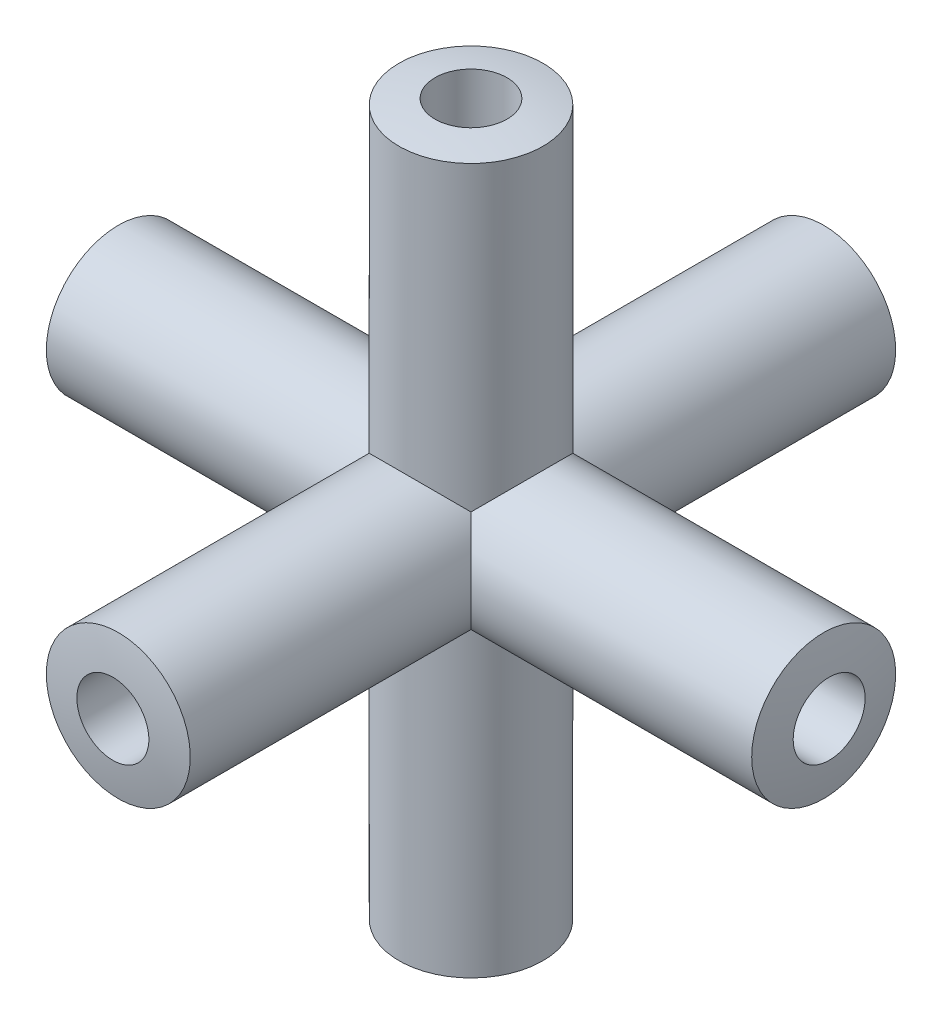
ISO-10303-21;
HEADER;
FILE_DESCRIPTION(('STEP AP214'),'2;1');
FILE_NAME('part.step','',(''),(''),'','','');
FILE_SCHEMA(('AUTOMOTIVE_DESIGN { 1 0 10303 214 1 1 1 1 }'));
ENDSEC;
DATA;
#1=APPLICATION_CONTEXT('core data for automotive mechanical design processes');
#2=APPLICATION_PROTOCOL_DEFINITION('international standard','automotive_design',2000,#1);
#3=PRODUCT_CONTEXT('',#1,'mechanical');
#4=PRODUCT('Part','Part','',(#3));
#5=PRODUCT_RELATED_PRODUCT_CATEGORY('part','',(#4));
#6=PRODUCT_DEFINITION_FORMATION('','',#4);
#7=PRODUCT_DEFINITION_CONTEXT('part definition',#1,'design');
#8=PRODUCT_DEFINITION('design','',#6,#7);
#9=PRODUCT_DEFINITION_SHAPE('','',#8);
#10=(LENGTH_UNIT() NAMED_UNIT(*) SI_UNIT(.MILLI.,.METRE.));
#11=(NAMED_UNIT(*) PLANE_ANGLE_UNIT() SI_UNIT($,.RADIAN.));
#12=(NAMED_UNIT(*) SI_UNIT($,.STERADIAN.) SOLID_ANGLE_UNIT());
#13=UNCERTAINTY_MEASURE_WITH_UNIT(LENGTH_MEASURE(1.E-05),#10,'distance_accuracy_value','');
#14=(GEOMETRIC_REPRESENTATION_CONTEXT(3) GLOBAL_UNCERTAINTY_ASSIGNED_CONTEXT((#13)) GLOBAL_UNIT_ASSIGNED_CONTEXT((#10,
#11,#12)) REPRESENTATION_CONTEXT('',''));
#15=CARTESIAN_POINT('',(0.,0.,0.));
#16=DIRECTION('',(0.,0.,1.));
#17=DIRECTION('',(1.,0.,0.));
#18=AXIS2_PLACEMENT_3D('',#15,#16,#17);
#19=CARTESIAN_POINT('',(-1.59032785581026E-05,-1.47377050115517E-05,37.4999840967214));
#20=DIRECTION('',(0.,0.,-1.));
#21=DIRECTION('',(-1.,0.,0.));
#22=AXIS2_PLACEMENT_3D('',#19,#20,#21);
#23=CYLINDRICAL_SURFACE('',#22,3.75);
#24=CARTESIAN_POINT('',(-1.59032784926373E-05,-1.47377049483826E-05,-18.7500159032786));
#25=DIRECTION('',(0.,0.,-1.));
#26=DIRECTION('',(0.,1.,0.));
#27=AXIS2_PLACEMENT_3D('',#24,#25,#26);
#28=CIRCLE('',#27,3.75);
#29=CARTESIAN_POINT('',(-1.59032784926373E-05,3.74998526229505,-18.7500159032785));
#30=VERTEX_POINT('',#29);
#31=EDGE_CURVE('E263',#30,#30,#28,.T.);
#32=ORIENTED_EDGE('',*,*,#31,.F.);
#33=EDGE_LOOP('',(#32));
#34=FACE_BOUND('',#33,.T.);
#35=CARTESIAN_POINT('',(-1.59032785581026E-05,-1.47377050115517E-05,-37.3120447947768));
#36=DIRECTION('',(0.,0.,1.));
#37=DIRECTION('',(1.,0.,0.));
#38=AXIS2_PLACEMENT_3D('',#35,#36,#37);
#39=CIRCLE('',#38,3.75);
#40=CARTESIAN_POINT('',(3.74998409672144,-1.47377050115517E-05,-37.3120447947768));
#41=VERTEX_POINT('',#40);
#42=EDGE_CURVE('E188',#41,#41,#39,.F.);
#43=ORIENTED_EDGE('',*,*,#42,.T.);
#44=EDGE_LOOP('',(#43));
#45=FACE_BOUND('',#44,.T.);
#46=ADVANCED_FACE('F38',(#34,#45),#23,.F.);
#47=CARTESIAN_POINT('',(-1.59032786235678E-05,-1.47377050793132E-05,18.7499840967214));
#48=DIRECTION('',(0.,0.,1.));
#49=DIRECTION('',(0.,1.,0.));
#50=AXIS2_PLACEMENT_3D('',#47,#48,#49);
#51=CIRCLE('',#50,3.75);
#52=CARTESIAN_POINT('',(-1.59032786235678E-05,3.74998526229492,18.7499840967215));
#53=VERTEX_POINT('',#52);
#54=EDGE_CURVE('E251',#53,#53,#51,.T.);
#55=ORIENTED_EDGE('',*,*,#54,.F.);
#56=EDGE_LOOP('',(#55));
#57=FACE_BOUND('',#56,.T.);
#58=CARTESIAN_POINT('',(-1.59032785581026E-05,-1.47377050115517E-05,37.3120129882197));
#59=DIRECTION('',(0.,0.,-1.));
#60=DIRECTION('',(-1.,0.,0.));
#61=AXIS2_PLACEMENT_3D('',#58,#59,#60);
#62=CIRCLE('',#61,3.75);
#63=CARTESIAN_POINT('',(-3.75001590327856,-1.47377050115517E-05,37.3120129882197));
#64=VERTEX_POINT('',#63);
#65=EDGE_CURVE('E176',#64,#64,#62,.F.);
#66=ORIENTED_EDGE('',*,*,#65,.T.);
#67=EDGE_LOOP('',(#66));
#68=FACE_BOUND('',#67,.T.);
#69=ADVANCED_FACE('F300',(#57,#68),#23,.F.);
#70=CARTESIAN_POINT('',(37.4999840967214,-1.47377050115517E-05,-1.59032785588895E-05));
#71=DIRECTION('',(-1.,0.,0.));
#72=DIRECTION('',(0.,0.,1.));
#73=AXIS2_PLACEMENT_3D('',#70,#71,#72);
#74=CYLINDRICAL_SURFACE('',#73,3.75);
#75=CARTESIAN_POINT('',(-18.7500159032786,-1.47377049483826E-05,-1.59032785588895E-05));
#76=DIRECTION('',(-1.,0.,0.));
#77=DIRECTION('',(0.,1.,0.));
#78=AXIS2_PLACEMENT_3D('',#75,#76,#77);
#79=CIRCLE('',#78,3.75);
#80=CARTESIAN_POINT('',(-18.7500159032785,3.74998526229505,-1.59032785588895E-05));
#81=VERTEX_POINT('',#80);
#82=EDGE_CURVE('E239',#81,#81,#79,.T.);
#83=ORIENTED_EDGE('',*,*,#82,.F.);
#84=EDGE_LOOP('',(#83));
#85=FACE_BOUND('',#84,.T.);
#86=CARTESIAN_POINT('',(-37.3120447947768,-1.47377050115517E-05,-1.59032785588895E-05));
#87=DIRECTION('',(1.,0.,0.));
#88=DIRECTION('',(0.,0.,-1.));
#89=AXIS2_PLACEMENT_3D('',#86,#87,#88);
#90=CIRCLE('',#89,3.75);
#91=CARTESIAN_POINT('',(-37.3120447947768,-1.47377050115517E-05,-3.75001590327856));
#92=VERTEX_POINT('',#91);
#93=EDGE_CURVE('E194',#92,#92,#90,.F.);
#94=ORIENTED_EDGE('',*,*,#93,.T.);
#95=EDGE_LOOP('',(#94));
#96=FACE_BOUND('',#95,.T.);
#97=ADVANCED_FACE('F372',(#85,#96),#74,.F.);
#98=CARTESIAN_POINT('',(18.7499840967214,-1.47377050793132E-05,-1.59032785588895E-05));
#99=DIRECTION('',(1.,0.,0.));
#100=DIRECTION('',(0.,1.,0.));
#101=AXIS2_PLACEMENT_3D('',#98,#99,#100);
#102=CIRCLE('',#101,3.75);
#103=CARTESIAN_POINT('',(18.7499840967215,3.74998526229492,-1.59032785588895E-05));
#104=VERTEX_POINT('',#103);
#105=EDGE_CURVE('E227',#104,#104,#102,.T.);
#106=ORIENTED_EDGE('',*,*,#105,.F.);
#107=EDGE_LOOP('',(#106));
#108=FACE_BOUND('',#107,.T.);
#109=CARTESIAN_POINT('',(37.3120129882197,-1.47377050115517E-05,-1.59032785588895E-05));
#110=DIRECTION('',(-1.,0.,0.));
#111=DIRECTION('',(0.,0.,1.));
#112=AXIS2_PLACEMENT_3D('',#109,#110,#111);
#113=CIRCLE('',#112,3.75);
#114=CARTESIAN_POINT('',(37.3120129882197,-1.47377050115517E-05,3.74998409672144));
#115=VERTEX_POINT('',#114);
#116=EDGE_CURVE('E197',#115,#115,#113,.F.);
#117=ORIENTED_EDGE('',*,*,#116,.T.);
#118=EDGE_LOOP('',(#117));
#119=FACE_BOUND('',#118,.T.);
#120=ADVANCED_FACE('F369',(#108,#119),#74,.F.);
#121=CARTESIAN_POINT('',(-1.59032785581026E-05,37.499985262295,-1.59032785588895E-05));
#122=DIRECTION('',(0.,-1.,0.));
#123=DIRECTION('',(0.,0.,-1.));
#124=AXIS2_PLACEMENT_3D('',#121,#122,#123);
#125=CYLINDRICAL_SURFACE('',#124,3.75);
#126=CARTESIAN_POINT('',(-1.59032785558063E-05,-18.750014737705,-1.59032785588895E-05));
#127=DIRECTION('',(0.,-1.,0.));
#128=DIRECTION('',(-1.,0.,0.));
#129=AXIS2_PLACEMENT_3D('',#126,#127,#128);
#130=CIRCLE('',#129,3.75);
#131=CARTESIAN_POINT('',(-3.75001590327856,-18.750014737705,-1.59032785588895E-05));
#132=VERTEX_POINT('',#131);
#133=EDGE_CURVE('E215',#132,#132,#130,.T.);
#134=ORIENTED_EDGE('',*,*,#133,.F.);
#135=EDGE_LOOP('',(#134));
#136=FACE_BOUND('',#135,.T.);
#137=CARTESIAN_POINT('',(-1.59032785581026E-05,-37.3120436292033,-1.59032785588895E-05));
#138=DIRECTION('',(0.,1.,0.));
#139=DIRECTION('',(0.,0.,1.));
#140=AXIS2_PLACEMENT_3D('',#137,#138,#139);
#141=CIRCLE('',#140,3.75);
#142=CARTESIAN_POINT('',(-3.75001590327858,-37.3120436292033,-1.59032785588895E-05));
#143=VERTEX_POINT('',#142);
#144=EDGE_CURVE('E42',#143,#143,#141,.F.);
#145=ORIENTED_EDGE('',*,*,#144,.T.);
#146=EDGE_LOOP('',(#145));
#147=FACE_BOUND('',#146,.T.);
#148=ADVANCED_FACE('F371',(#136,#147),#125,.F.);
#149=CARTESIAN_POINT('',(-1.59032785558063E-05,18.749985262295,-1.59032785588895E-05));
#150=DIRECTION('',(0.,1.,0.));
#151=DIRECTION('',(-1.,0.,0.));
#152=AXIS2_PLACEMENT_3D('',#149,#150,#151);
#153=CIRCLE('',#152,3.75);
#154=CARTESIAN_POINT('',(-3.75001590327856,18.749985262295,-1.59032785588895E-05));
#155=VERTEX_POINT('',#154);
#156=EDGE_CURVE('E203',#155,#155,#153,.T.);
#157=ORIENTED_EDGE('',*,*,#156,.F.);
#158=EDGE_LOOP('',(#157));
#159=FACE_BOUND('',#158,.T.);
#160=CARTESIAN_POINT('',(-1.59032785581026E-05,37.3120141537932,-1.59032785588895E-05));
#161=DIRECTION('',(0.,-1.,0.));
#162=DIRECTION('',(0.,0.,-1.));
#163=AXIS2_PLACEMENT_3D('',#160,#161,#162);
#164=CIRCLE('',#163,3.75);
#165=CARTESIAN_POINT('',(-3.75001590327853,37.3120141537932,-1.59032785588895E-05));
#166=VERTEX_POINT('',#165);
#167=EDGE_CURVE('E170',#166,#166,#164,.F.);
#168=ORIENTED_EDGE('',*,*,#167,.T.);
#169=EDGE_LOOP('',(#168));
#170=FACE_BOUND('',#169,.T.);
#171=ADVANCED_FACE('F378',(#159,#170),#125,.F.);
#172=CARTESIAN_POINT('',(-1.59032785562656E-05,-15.000014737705,-1.59032785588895E-05));
#173=DIRECTION('',(0.,-1.,0.));
#174=DIRECTION('',(-1.,0.,0.));
#175=AXIS2_PLACEMENT_3D('',#172,#173,#174);
#176=CIRCLE('',#175,3.75);
#177=CARTESIAN_POINT('',(-3.75001590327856,-15.000014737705,-1.59032785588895E-05));
#178=VERTEX_POINT('',#177);
#179=EDGE_CURVE('E224',#178,#178,#176,.T.);
#180=ORIENTED_EDGE('',*,*,#179,.T.);
#181=EDGE_LOOP('',(#180));
#182=FACE_BOUND('',#181,.T.);
#183=CARTESIAN_POINT('',(-1.59032785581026E-05,-1.47377050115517E-05,-1.59032785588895E-05));
#184=DIRECTION('',(0.707106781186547,-0.707106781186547,0.));
#185=DIRECTION('',(-0.707106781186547,-0.707106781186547,0.));
#186=AXIS2_PLACEMENT_3D('',#183,#184,#185);
#187=ELLIPSE('',#186,5.30330085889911,3.75);
#188=CARTESIAN_POINT('',(-2.65166633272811,-2.65166516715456,2.65163452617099));
#189=VERTEX_POINT('',#188);
#190=CARTESIAN_POINT('',(-2.65166633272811,-2.65166516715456,-2.65166633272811));
#191=VERTEX_POINT('',#190);
#192=EDGE_CURVE('E11',#189,#191,#187,.T.);
#193=ORIENTED_EDGE('',*,*,#192,.F.);
#194=CARTESIAN_POINT('',(-1.59032785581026E-05,-1.47377050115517E-05,-1.59032785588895E-05));
#195=DIRECTION('',(0.,-0.707106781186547,-0.707106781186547));
#196=DIRECTION('',(0.,-0.707106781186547,0.707106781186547));
#197=AXIS2_PLACEMENT_3D('',#194,#195,#196);
#198=ELLIPSE('',#197,5.30330085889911,3.75);
#199=CARTESIAN_POINT('',(2.65163452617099,-2.65166516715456,2.65163452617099));
#200=VERTEX_POINT('',#199);
#201=EDGE_CURVE('E114',#200,#189,#198,.T.);
#202=ORIENTED_EDGE('',*,*,#201,.F.);
#203=CARTESIAN_POINT('',(-1.59032785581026E-05,-1.47377050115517E-05,-1.59032785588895E-05));
#204=DIRECTION('',(-0.707106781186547,-0.707106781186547,0.));
#205=DIRECTION('',(0.707106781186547,-0.707106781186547,0.));
#206=AXIS2_PLACEMENT_3D('',#203,#204,#205);
#207=ELLIPSE('',#206,5.30330085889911,3.75);
#208=CARTESIAN_POINT('',(2.65163452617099,-2.65166516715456,-2.65166633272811));
#209=VERTEX_POINT('',#208);
#210=EDGE_CURVE('E47',#209,#200,#207,.T.);
#211=ORIENTED_EDGE('',*,*,#210,.F.);
#212=CARTESIAN_POINT('',(-1.59032785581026E-05,-1.47377050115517E-05,-1.59032785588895E-05));
#213=DIRECTION('',(0.,-0.707106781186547,0.707106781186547));
#214=DIRECTION('',(0.,-0.707106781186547,-0.707106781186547));
#215=AXIS2_PLACEMENT_3D('',#212,#213,#214);
#216=ELLIPSE('',#215,5.30330085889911,3.75);
#217=EDGE_CURVE('E119',#191,#209,#216,.T.);
#218=ORIENTED_EDGE('',*,*,#217,.F.);
#219=EDGE_LOOP('',(#193,#202,#211,#218));
#220=FACE_BOUND('',#219,.T.);
#221=ADVANCED_FACE('F118',(#182,#220),#125,.F.);
#222=CARTESIAN_POINT('',(14.9999840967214,-1.47377050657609E-05,-1.59032785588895E-05));
#223=DIRECTION('',(1.,0.,0.));
#224=DIRECTION('',(0.,1.,0.));
#225=AXIS2_PLACEMENT_3D('',#222,#223,#224);
#226=CIRCLE('',#225,3.75);
#227=CARTESIAN_POINT('',(14.9999840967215,3.74998526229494,-1.59032785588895E-05));
#228=VERTEX_POINT('',#227);
#229=EDGE_CURVE('E236',#228,#228,#226,.T.);
#230=ORIENTED_EDGE('',*,*,#229,.T.);
#231=EDGE_LOOP('',(#230));
#232=FACE_BOUND('',#231,.T.);
#233=CARTESIAN_POINT('',(-1.59032785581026E-05,-1.47377050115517E-05,-1.59032785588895E-05));
#234=DIRECTION('',(0.707106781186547,-0.707106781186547,0.));
#235=DIRECTION('',(-0.707106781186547,-0.707106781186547,0.));
#236=AXIS2_PLACEMENT_3D('',#233,#234,#235);
#237=ELLIPSE('',#236,5.30330085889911,3.75);
#238=CARTESIAN_POINT('',(2.65163452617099,2.65163569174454,2.65163452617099));
#239=VERTEX_POINT('',#238);
#240=CARTESIAN_POINT('',(2.65163452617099,2.65163569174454,-2.65166633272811));
#241=VERTEX_POINT('',#240);
#242=EDGE_CURVE('E116',#239,#241,#237,.F.);
#243=ORIENTED_EDGE('',*,*,#242,.T.);
#244=CARTESIAN_POINT('',(-1.59032785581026E-05,-1.47377050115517E-05,-1.59032785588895E-05));
#245=DIRECTION('',(-0.707106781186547,0.,-0.707106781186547));
#246=DIRECTION('',(0.707106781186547,0.,-0.707106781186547));
#247=AXIS2_PLACEMENT_3D('',#244,#245,#246);
#248=ELLIPSE('',#247,5.30330085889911,3.75);
#249=EDGE_CURVE('E61',#241,#209,#248,.T.);
#250=ORIENTED_EDGE('',*,*,#249,.T.);
#251=ORIENTED_EDGE('',*,*,#210,.T.);
#252=CARTESIAN_POINT('',(-1.59032785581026E-05,-1.47377050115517E-05,-1.59032785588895E-05));
#253=DIRECTION('',(0.707106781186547,0.,-0.707106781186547));
#254=DIRECTION('',(-0.707106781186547,0.,-0.707106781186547));
#255=AXIS2_PLACEMENT_3D('',#252,#253,#254);
#256=ELLIPSE('',#255,5.30330085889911,3.75);
#257=EDGE_CURVE('E102',#200,#239,#256,.F.);
#258=ORIENTED_EDGE('',*,*,#257,.T.);
#259=EDGE_LOOP('',(#243,#250,#251,#258));
#260=FACE_BOUND('',#259,.T.);
#261=ADVANCED_FACE('F101',(#232,#260),#74,.F.);
#262=CARTESIAN_POINT('',(-15.0000159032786,-1.47377049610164E-05,-1.59032785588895E-05));
#263=DIRECTION('',(-1.,0.,0.));
#264=DIRECTION('',(0.,1.,0.));
#265=AXIS2_PLACEMENT_3D('',#262,#263,#264);
#266=CIRCLE('',#265,3.75);
#267=CARTESIAN_POINT('',(-15.0000159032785,3.74998526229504,-1.59032785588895E-05));
#268=VERTEX_POINT('',#267);
#269=EDGE_CURVE('E248',#268,#268,#266,.T.);
#270=ORIENTED_EDGE('',*,*,#269,.T.);
#271=EDGE_LOOP('',(#270));
#272=FACE_BOUND('',#271,.T.);
#273=CARTESIAN_POINT('',(-1.59032785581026E-05,-1.47377050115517E-05,-1.59032785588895E-05));
#274=DIRECTION('',(-0.707106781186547,-0.707106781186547,0.));
#275=DIRECTION('',(0.707106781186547,-0.707106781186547,0.));
#276=AXIS2_PLACEMENT_3D('',#273,#274,#275);
#277=ELLIPSE('',#276,5.30330085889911,3.75);
#278=CARTESIAN_POINT('',(-2.65166633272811,2.65163569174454,-2.65166633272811));
#279=VERTEX_POINT('',#278);
#280=CARTESIAN_POINT('',(-2.65166633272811,2.65163569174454,2.65163452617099));
#281=VERTEX_POINT('',#280);
#282=EDGE_CURVE('E163',#279,#281,#277,.F.);
#283=ORIENTED_EDGE('',*,*,#282,.T.);
#284=CARTESIAN_POINT('',(-1.59032785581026E-05,-1.47377050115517E-05,-1.59032785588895E-05));
#285=DIRECTION('',(-0.707106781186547,0.,-0.707106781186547));
#286=DIRECTION('',(0.707106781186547,0.,-0.707106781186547));
#287=AXIS2_PLACEMENT_3D('',#284,#285,#286);
#288=ELLIPSE('',#287,5.30330085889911,3.75);
#289=EDGE_CURVE('E53',#281,#189,#288,.F.);
#290=ORIENTED_EDGE('',*,*,#289,.T.);
#291=ORIENTED_EDGE('',*,*,#192,.T.);
#292=CARTESIAN_POINT('',(-1.59032785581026E-05,-1.47377050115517E-05,-1.59032785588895E-05));
#293=DIRECTION('',(0.707106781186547,0.,-0.707106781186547));
#294=DIRECTION('',(-0.707106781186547,0.,-0.707106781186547));
#295=AXIS2_PLACEMENT_3D('',#292,#293,#294);
#296=ELLIPSE('',#295,5.30330085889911,3.75);
#297=EDGE_CURVE('E166',#191,#279,#296,.T.);
#298=ORIENTED_EDGE('',*,*,#297,.T.);
#299=EDGE_LOOP('',(#283,#290,#291,#298));
#300=FACE_BOUND('',#299,.T.);
#301=ADVANCED_FACE('F382',(#272,#300),#74,.F.);
#302=CARTESIAN_POINT('',(-1.59032785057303E-05,-1.47377049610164E-05,-15.0000159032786));
#303=DIRECTION('',(0.,0.,-1.));
#304=DIRECTION('',(0.,1.,0.));
#305=AXIS2_PLACEMENT_3D('',#302,#303,#304);
#306=CIRCLE('',#305,3.75);
#307=CARTESIAN_POINT('',(-1.59032785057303E-05,3.74998526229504,-15.0000159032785));
#308=VERTEX_POINT('',#307);
#309=EDGE_CURVE('E272',#308,#308,#306,.T.);
#310=ORIENTED_EDGE('',*,*,#309,.T.);
#311=EDGE_LOOP('',(#310));
#312=FACE_BOUND('',#311,.T.);
#313=ORIENTED_EDGE('',*,*,#297,.F.);
#314=ORIENTED_EDGE('',*,*,#217,.T.);
#315=ORIENTED_EDGE('',*,*,#249,.F.);
#316=CARTESIAN_POINT('',(-1.59032785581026E-05,-1.47377050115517E-05,-1.59032785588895E-05));
#317=DIRECTION('',(0.,-0.707106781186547,-0.707106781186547));
#318=DIRECTION('',(0.,-0.707106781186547,0.707106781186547));
#319=AXIS2_PLACEMENT_3D('',#316,#317,#318);
#320=ELLIPSE('',#319,5.30330085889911,3.75);
#321=EDGE_CURVE('E120',#241,#279,#320,.F.);
#322=ORIENTED_EDGE('',*,*,#321,.T.);
#323=EDGE_LOOP('',(#313,#314,#315,#322));
#324=FACE_BOUND('',#323,.T.);
#325=ADVANCED_FACE('F276',(#312,#324),#23,.F.);
#326=CARTESIAN_POINT('',(-1.59032786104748E-05,-1.47377050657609E-05,14.9999840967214));
#327=DIRECTION('',(0.,0.,1.));
#328=DIRECTION('',(0.,1.,0.));
#329=AXIS2_PLACEMENT_3D('',#326,#327,#328);
#330=CIRCLE('',#329,3.75);
#331=CARTESIAN_POINT('',(-1.59032786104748E-05,3.74998526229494,14.9999840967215));
#332=VERTEX_POINT('',#331);
#333=EDGE_CURVE('E260',#332,#332,#330,.T.);
#334=ORIENTED_EDGE('',*,*,#333,.T.);
#335=EDGE_LOOP('',(#334));
#336=FACE_BOUND('',#335,.T.);
#337=ORIENTED_EDGE('',*,*,#257,.F.);
#338=ORIENTED_EDGE('',*,*,#201,.T.);
#339=ORIENTED_EDGE('',*,*,#289,.F.);
#340=CARTESIAN_POINT('',(-1.59032785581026E-05,-1.47377050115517E-05,-1.59032785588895E-05));
#341=DIRECTION('',(0.,-0.707106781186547,0.707106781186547));
#342=DIRECTION('',(0.,-0.707106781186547,-0.707106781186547));
#343=AXIS2_PLACEMENT_3D('',#340,#341,#342);
#344=ELLIPSE('',#343,5.30330085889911,3.75);
#345=EDGE_CURVE('E108',#281,#239,#344,.F.);
#346=ORIENTED_EDGE('',*,*,#345,.T.);
#347=EDGE_LOOP('',(#337,#338,#339,#346));
#348=FACE_BOUND('',#347,.T.);
#349=ADVANCED_FACE('F113',(#336,#348),#23,.F.);
#350=CARTESIAN_POINT('',(-1.59032785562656E-05,14.999985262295,-1.59032785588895E-05));
#351=DIRECTION('',(0.,1.,0.));
#352=DIRECTION('',(-1.,0.,0.));
#353=AXIS2_PLACEMENT_3D('',#350,#351,#352);
#354=CIRCLE('',#353,3.75);
#355=CARTESIAN_POINT('',(-3.75001590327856,14.999985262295,-1.59032785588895E-05));
#356=VERTEX_POINT('',#355);
#357=EDGE_CURVE('E212',#356,#356,#354,.T.);
#358=ORIENTED_EDGE('',*,*,#357,.T.);
#359=EDGE_LOOP('',(#358));
#360=FACE_BOUND('',#359,.T.);
#361=ORIENTED_EDGE('',*,*,#242,.F.);
#362=ORIENTED_EDGE('',*,*,#345,.F.);
#363=ORIENTED_EDGE('',*,*,#282,.F.);
#364=ORIENTED_EDGE('',*,*,#321,.F.);
#365=EDGE_LOOP('',(#361,#362,#363,#364));
#366=FACE_BOUND('',#365,.T.);
#367=ADVANCED_FACE('F334',(#360,#366),#125,.F.);
#368=CARTESIAN_POINT('',(-1.59032785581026E-05,-1.47377050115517E-05,-1.59032785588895E-05));
#369=DIRECTION('',(0.,-1.,0.));
#370=DIRECTION('',(-1.,0.,0.));
#371=AXIS2_PLACEMENT_3D('',#368,#369,#370);
#372=SPHERICAL_SURFACE('',#371,37.5);
#373=CARTESIAN_POINT('',(-1.59032785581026E-05,-36.7423608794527,-1.59032785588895E-05));
#374=DIRECTION('',(0.,1.,0.));
#375=DIRECTION('',(0.,0.,1.));
#376=AXIS2_PLACEMENT_3D('',#373,#374,#375);
#377=CIRCLE('',#376,7.5);
#378=CARTESIAN_POINT('',(-7.50001590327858,-36.7423608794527,-1.59032785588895E-05));
#379=VERTEX_POINT('',#378);
#380=EDGE_CURVE('E179',#379,#379,#377,.F.);
#381=CARTESIAN_POINT('',(-3.75001590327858,-37.3120436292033,-1.59032785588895E-05));
#382=CARTESIAN_POINT('',(-3.78934530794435,-37.3080908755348,-1.59032785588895E-05));
#383=CARTESIAN_POINT('',(-3.82866846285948,-37.3040759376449,-1.59032785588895E-05));
#384=CARTESIAN_POINT('',(-3.90730188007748,-37.2959217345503,-1.59032785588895E-05));
#385=CARTESIAN_POINT('',(-3.94661214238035,-37.2917824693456,-1.59032785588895E-05));
#386=CARTESIAN_POINT('',(-4.02521938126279,-37.2833796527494,-1.59032785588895E-05));
#387=CARTESIAN_POINT('',(-4.06451635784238,-37.2791161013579,-1.59032785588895E-05));
#388=CARTESIAN_POINT('',(-4.14309663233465,-37.2704647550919,-1.59032785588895E-05));
#389=CARTESIAN_POINT('',(-4.18237993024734,-37.2660769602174,-1.59032785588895E-05));
#390=CARTESIAN_POINT('',(-4.26093245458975,-37.2571771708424,-1.59032785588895E-05));
#391=CARTESIAN_POINT('',(-4.30020168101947,-37.2526651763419,-1.59032785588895E-05));
#392=CARTESIAN_POINT('',(-4.37872566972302,-37.2435170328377,-1.59032785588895E-05));
#393=CARTESIAN_POINT('',(-4.41798043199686,-37.238880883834,-1.59032785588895E-05));
#394=CARTESIAN_POINT('',(-4.49647509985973,-37.2294844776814,-1.59032785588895E-05));
#395=CARTESIAN_POINT('',(-4.53571500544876,-37.2247242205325,-1.59032785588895E-05));
#396=CARTESIAN_POINT('',(-4.61417956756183,-37.2150796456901,-1.59032785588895E-05));
#397=CARTESIAN_POINT('',(-4.65340422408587,-37.2101953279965,-1.59032785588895E-05));
#398=CARTESIAN_POINT('',(-4.73183789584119,-37.2003026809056,-1.59032785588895E-05));
#399=CARTESIAN_POINT('',(-4.77104691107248,-37.1952943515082,-1.59032785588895E-05));
#400=CARTESIAN_POINT('',(-4.84944890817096,-37.1851537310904,-1.59032785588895E-05));
#401=CARTESIAN_POINT('',(-4.88864189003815,-37.1800214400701,-1.59032785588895E-05));
#402=CARTESIAN_POINT('',(-4.96701142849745,-37.1696329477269,-1.59032785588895E-05));
#403=CARTESIAN_POINT('',(-5.00618798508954,-37.164376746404,-1.59032785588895E-05));
#404=CARTESIAN_POINT('',(-5.08452428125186,-37.1537404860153,-1.59032785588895E-05));
#405=CARTESIAN_POINT('',(-5.12368402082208,-37.1483604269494,-1.59032785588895E-05));
#406=CARTESIAN_POINT('',(-5.20198629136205,-37.1374765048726,-1.59032785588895E-05));
#407=CARTESIAN_POINT('',(-5.24112882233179,-37.1319726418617,-1.59032785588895E-05));
#408=CARTESIAN_POINT('',(-5.31939628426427,-37.1208411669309,-1.59032785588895E-05));
#409=CARTESIAN_POINT('',(-5.35852121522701,-37.115213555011,-1.59032785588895E-05));
#410=CARTESIAN_POINT('',(-5.43675308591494,-37.1038346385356,-1.59032785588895E-05));
#411=CARTESIAN_POINT('',(-5.47586002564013,-37.0980833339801,-1.59032785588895E-05));
#412=CARTESIAN_POINT('',(-5.55405552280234,-37.0864570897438,-1.59032785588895E-05));
#413=CARTESIAN_POINT('',(-5.59314408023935,-37.0805821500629,-1.59032785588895E-05));
#414=CARTESIAN_POINT('',(-5.67130242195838,-37.0687086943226,-1.59032785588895E-05));
#415=CARTESIAN_POINT('',(-5.7103722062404,-37.062710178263,-1.59032785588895E-05));
#416=CARTESIAN_POINT('',(-5.78849261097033,-37.0505896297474,-1.59032785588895E-05));
#417=CARTESIAN_POINT('',(-5.82754323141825,-37.0444675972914,-1.59032785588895E-05));
#418=CARTESIAN_POINT('',(-5.90562491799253,-37.0321000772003,-1.59032785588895E-05));
#419=CARTESIAN_POINT('',(-5.94465598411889,-37.0258545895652,-1.59032785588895E-05));
#420=CARTESIAN_POINT('',(-6.0226981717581,-37.0132402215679,-1.59032785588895E-05));
#421=CARTESIAN_POINT('',(-6.06170929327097,-37.0068713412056,-1.59032785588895E-05));
#422=CARTESIAN_POINT('',(-6.13971120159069,-36.9940102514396,-1.59032785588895E-05));
#423=CARTESIAN_POINT('',(-6.17870198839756,-36.9875180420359,-1.59032785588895E-05));
#424=CARTESIAN_POINT('',(-6.25666283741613,-36.9744103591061,-1.59032785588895E-05));
#425=CARTESIAN_POINT('',(-6.29563289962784,-36.9677948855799,-1.59032785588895E-05));
#426=CARTESIAN_POINT('',(-6.37355190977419,-36.9544407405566,-1.59032785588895E-05));
#427=CARTESIAN_POINT('',(-6.41250085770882,-36.9477020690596,-1.59032785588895E-05));
#428=CARTESIAN_POINT('',(-6.49037724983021,-36.934101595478,-1.59032785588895E-05));
#429=CARTESIAN_POINT('',(-6.52930469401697,-36.9272397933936,-1.59032785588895E-05));
#430=CARTESIAN_POINT('',(-6.60713768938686,-36.9133931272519,-1.59032785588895E-05));
#431=CARTESIAN_POINT('',(-6.64604324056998,-36.9064082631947,-1.59032785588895E-05));
#432=CARTESIAN_POINT('',(-6.72383206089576,-36.892315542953,-1.59032785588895E-05));
#433=CARTESIAN_POINT('',(-6.76271533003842,-36.8852076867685,-1.59032785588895E-05));
#434=CARTESIAN_POINT('',(-6.84045919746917,-36.8708690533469,-1.59032785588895E-05));
#435=CARTESIAN_POINT('',(-6.87931979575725,-36.8636382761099,-1.59032785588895E-05));
#436=CARTESIAN_POINT('',(-6.95701793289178,-36.8490538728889,-1.59032785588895E-05));
#437=CARTESIAN_POINT('',(-6.99585547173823,-36.841700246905,-1.59032785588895E-05));
#438=CARTESIAN_POINT('',(-7.07350710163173,-36.826870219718,-1.59032785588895E-05));
#439=CARTESIAN_POINT('',(-7.11232119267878,-36.8193938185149,-1.59032785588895E-05));
#440=CARTESIAN_POINT('',(-7.18992553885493,-36.8043183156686,-1.59032785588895E-05));
#441=CARTESIAN_POINT('',(-7.22871579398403,-36.7967192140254,-1.59032785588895E-05));
#442=CARTESIAN_POINT('',(-7.3062720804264,-36.7813983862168,-1.59032785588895E-05));
#443=CARTESIAN_POINT('',(-7.34503811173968,-36.7736766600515,-1.59032785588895E-05));
#444=CARTESIAN_POINT('',(-7.4225455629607,-36.7581106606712,-1.59032785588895E-05));
#445=CARTESIAN_POINT('',(-7.46128698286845,-36.7502663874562,-1.59032785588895E-05));
#446=CARTESIAN_POINT('',(-7.50001590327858,-36.7423608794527,-1.59032785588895E-05));
#447=B_SPLINE_CURVE_WITH_KNOTS('',3,(#381,#382,#383,#384,#385,#386,#387,#388,#389,#390,#391,
#392,#393,#394,#395,#396,#397,#398,#399,#400,#401,#402,#403,#404,#405,#406,#407,#408,#409,#410,
#411,#412,#413,#414,#415,#416,#417,#418,#419,#420,#421,#422,#423,#424,#425,#426,#427,#428,#429,
#430,#431,#432,#433,#434,#435,#436,#437,#438,#439,#440,#441,#442,#443,#444,#445,#446),
.UNSPECIFIED.,.F.,.F.,(4,2,2,2,2,2,2,2,2,2,2,2,2,2,2,2,2,2,2,2,2,2,2,2,2,2,2,2,2,2,2,2,4),(0.,
0.118582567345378,0.237165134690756,0.355747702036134,0.474330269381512,0.59291283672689,
0.711495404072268,0.830077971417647,0.948660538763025,1.0672431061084,1.18582567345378,
1.30440824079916,1.42299080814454,1.54157337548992,1.66015594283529,1.77873851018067,
1.89732107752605,2.01590364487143,2.13448621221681,2.25306877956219,2.37165134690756,
2.49023391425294,2.60881648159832,2.7273990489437,2.84598161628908,2.96456418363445,
3.08314675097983,3.20172931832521,3.32031188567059,3.43889445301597,3.55747702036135,
3.67605958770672,3.7946421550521),.UNSPECIFIED.);
#448=EDGE_CURVE('BSEAM327',#143,#379,#447,.T.);
#449=ORIENTED_EDGE('',*,*,#144,.F.);
#450=ORIENTED_EDGE('',*,*,#380,.T.);
#451=ORIENTED_EDGE('',*,*,#448,.T.);
#452=ORIENTED_EDGE('',*,*,#448,.F.);
#453=EDGE_LOOP('',(#449,#451,#450,#452));
#454=FACE_BOUND('',#453,.T.);
#455=ADVANCED_FACE('F327',(#454),#372,.T.);
#456=CARTESIAN_POINT('',(-1.59032785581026E-05,-1.47377050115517E-05,37.4999840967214));
#457=DIRECTION('',(0.,0.,-1.));
#458=DIRECTION('',(-1.,0.,0.));
#459=AXIS2_PLACEMENT_3D('',#456,#457,#458);
#460=CYLINDRICAL_SURFACE('',#459,7.5);
#461=CARTESIAN_POINT('',(-1.59032785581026E-05,-1.47377050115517E-05,-1.59032785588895E-05));
#462=DIRECTION('',(-0.707106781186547,0.,-0.707106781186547));
#463=DIRECTION('',(0.707106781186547,0.,-0.707106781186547));
#464=AXIS2_PLACEMENT_3D('',#461,#462,#463);
#465=ELLIPSE('',#464,10.6066017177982,7.5);
#466=CARTESIAN_POINT('',(-5.30331676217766,-5.30331559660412,5.30328495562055));
#467=VERTEX_POINT('',#466);
#468=CARTESIAN_POINT('',(-5.30331676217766,5.30328612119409,5.30328495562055));
#469=VERTEX_POINT('',#468);
#470=EDGE_CURVE('E151',#467,#469,#465,.T.);
#471=ORIENTED_EDGE('',*,*,#470,.F.);
#472=CARTESIAN_POINT('',(-1.59032785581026E-05,-1.47377050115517E-05,-1.59032785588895E-05));
#473=DIRECTION('',(0.,-0.707106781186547,-0.707106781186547));
#474=DIRECTION('',(0.,0.707106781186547,-0.707106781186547));
#475=AXIS2_PLACEMENT_3D('',#472,#473,#474);
#476=ELLIPSE('',#475,10.6066017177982,7.5);
#477=CARTESIAN_POINT('',(5.30328495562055,-5.30331559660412,5.30328495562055));
#478=VERTEX_POINT('',#477);
#479=EDGE_CURVE('E130',#478,#467,#476,.T.);
#480=ORIENTED_EDGE('',*,*,#479,.F.);
#481=CARTESIAN_POINT('',(-1.59032785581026E-05,-1.47377050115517E-05,-1.59032785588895E-05));
#482=DIRECTION('',(0.707106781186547,0.,-0.707106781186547));
#483=DIRECTION('',(-0.707106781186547,0.,-0.707106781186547));
#484=AXIS2_PLACEMENT_3D('',#481,#482,#483);
#485=ELLIPSE('',#484,10.6066017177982,7.5);
#486=CARTESIAN_POINT('',(5.30328495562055,5.30328612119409,5.30328495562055));
#487=VERTEX_POINT('',#486);
#488=EDGE_CURVE('E139',#487,#478,#485,.T.);
#489=ORIENTED_EDGE('',*,*,#488,.F.);
#490=CARTESIAN_POINT('',(-1.59032785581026E-05,-1.47377050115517E-05,-1.59032785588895E-05));
#491=DIRECTION('',(0.,0.707106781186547,-0.707106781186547));
#492=DIRECTION('',(0.,-0.707106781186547,-0.707106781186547));
#493=AXIS2_PLACEMENT_3D('',#490,#491,#492);
#494=ELLIPSE('',#493,10.6066017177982,7.5);
#495=EDGE_CURVE('E133',#469,#487,#494,.T.);
#496=ORIENTED_EDGE('',*,*,#495,.F.);
#497=EDGE_LOOP('',(#471,#480,#489,#496));
#498=FACE_BOUND('',#497,.T.);
#499=CARTESIAN_POINT('',(-1.59032785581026E-05,-1.47377050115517E-05,36.7423302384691));
#500=DIRECTION('',(0.,0.,-1.));
#501=DIRECTION('',(-1.,0.,0.));
#502=AXIS2_PLACEMENT_3D('',#499,#500,#501);
#503=CIRCLE('',#502,7.5);
#504=CARTESIAN_POINT('',(-7.50001590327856,-1.47377050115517E-05,36.7423302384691));
#505=VERTEX_POINT('',#504);
#506=EDGE_CURVE('E173',#505,#505,#503,.F.);
#507=ORIENTED_EDGE('',*,*,#506,.F.);
#508=EDGE_LOOP('',(#507));
#509=FACE_BOUND('',#508,.T.);
#510=ADVANCED_FACE('F40',(#498,#509),#460,.T.);
#511=CARTESIAN_POINT('',(-1.59032785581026E-05,37.499985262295,-1.59032785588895E-05));
#512=DIRECTION('',(0.,-1.,0.));
#513=DIRECTION('',(0.,0.,-1.));
#514=AXIS2_PLACEMENT_3D('',#511,#512,#513);
#515=CYLINDRICAL_SURFACE('',#514,7.5);
#516=CARTESIAN_POINT('',(-1.59032785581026E-05,-1.47377050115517E-05,-1.59032785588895E-05));
#517=DIRECTION('',(-0.707106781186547,-0.707106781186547,0.));
#518=DIRECTION('',(0.707106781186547,-0.707106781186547,0.));
#519=AXIS2_PLACEMENT_3D('',#516,#517,#518);
#520=ELLIPSE('',#519,10.6066017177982,7.5);
#521=CARTESIAN_POINT('',(5.30328495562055,-5.30331559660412,-5.30331676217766));
#522=VERTEX_POINT('',#521);
#523=EDGE_CURVE('E142',#478,#522,#520,.F.);
#524=ORIENTED_EDGE('',*,*,#523,.F.);
#525=ORIENTED_EDGE('',*,*,#479,.T.);
#526=CARTESIAN_POINT('',(-1.59032785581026E-05,-1.47377050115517E-05,-1.59032785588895E-05));
#527=DIRECTION('',(0.707106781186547,-0.707106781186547,0.));
#528=DIRECTION('',(-0.707106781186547,-0.707106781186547,0.));
#529=AXIS2_PLACEMENT_3D('',#526,#527,#528);
#530=ELLIPSE('',#529,10.6066017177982,7.5);
#531=CARTESIAN_POINT('',(-5.30331676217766,-5.30331559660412,-5.30331676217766));
#532=VERTEX_POINT('',#531);
#533=EDGE_CURVE('E154',#532,#467,#530,.F.);
#534=ORIENTED_EDGE('',*,*,#533,.F.);
#535=CARTESIAN_POINT('',(-1.59032785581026E-05,-1.47377050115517E-05,-1.59032785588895E-05));
#536=DIRECTION('',(0.,0.707106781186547,-0.707106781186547));
#537=DIRECTION('',(0.,-0.707106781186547,-0.707106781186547));
#538=AXIS2_PLACEMENT_3D('',#535,#536,#537);
#539=ELLIPSE('',#538,10.6066017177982,7.5);
#540=EDGE_CURVE('E136',#532,#522,#539,.F.);
#541=ORIENTED_EDGE('',*,*,#540,.T.);
#542=EDGE_LOOP('',(#524,#525,#534,#541));
#543=FACE_BOUND('',#542,.T.);
#544=ORIENTED_EDGE('',*,*,#380,.F.);
#545=EDGE_LOOP('',(#544));
#546=FACE_BOUND('',#545,.T.);
#547=ADVANCED_FACE('F323',(#543,#546),#515,.T.);
#548=CARTESIAN_POINT('',(-1.59032785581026E-05,-1.47377050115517E-05,-1.59032785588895E-05));
#549=DIRECTION('',(-0.707106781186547,-0.707106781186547,0.));
#550=DIRECTION('',(0.707106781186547,-0.707106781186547,0.));
#551=AXIS2_PLACEMENT_3D('',#548,#549,#550);
#552=ELLIPSE('',#551,10.6066017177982,7.5);
#553=CARTESIAN_POINT('',(-5.30331676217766,5.30328612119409,-5.30331676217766));
#554=VERTEX_POINT('',#553);
#555=EDGE_CURVE('E157',#469,#554,#552,.T.);
#556=ORIENTED_EDGE('',*,*,#555,.F.);
#557=ORIENTED_EDGE('',*,*,#495,.T.);
#558=CARTESIAN_POINT('',(-1.59032785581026E-05,-1.47377050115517E-05,-1.59032785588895E-05));
#559=DIRECTION('',(0.707106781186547,-0.707106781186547,0.));
#560=DIRECTION('',(-0.707106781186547,-0.707106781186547,0.));
#561=AXIS2_PLACEMENT_3D('',#558,#559,#560);
#562=ELLIPSE('',#561,10.6066017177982,7.5);
#563=CARTESIAN_POINT('',(5.30328495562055,5.30328612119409,-5.30331676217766));
#564=VERTEX_POINT('',#563);
#565=EDGE_CURVE('E145',#564,#487,#562,.T.);
#566=ORIENTED_EDGE('',*,*,#565,.F.);
#567=CARTESIAN_POINT('',(-1.59032785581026E-05,-1.47377050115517E-05,-1.59032785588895E-05));
#568=DIRECTION('',(0.,-0.707106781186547,-0.707106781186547));
#569=DIRECTION('',(0.,0.707106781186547,-0.707106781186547));
#570=AXIS2_PLACEMENT_3D('',#567,#568,#569);
#571=ELLIPSE('',#570,10.6066017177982,7.5);
#572=EDGE_CURVE('E124',#564,#554,#571,.F.);
#573=ORIENTED_EDGE('',*,*,#572,.T.);
#574=EDGE_LOOP('',(#556,#557,#566,#573));
#575=FACE_BOUND('',#574,.T.);
#576=CARTESIAN_POINT('',(-1.59032785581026E-05,36.7423314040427,-1.59032785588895E-05));
#577=DIRECTION('',(0.,-1.,0.));
#578=DIRECTION('',(0.,0.,-1.));
#579=AXIS2_PLACEMENT_3D('',#576,#577,#578);
#580=CIRCLE('',#579,7.5);
#581=CARTESIAN_POINT('',(-7.5000159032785,36.7423314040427,-1.59032785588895E-05));
#582=VERTEX_POINT('',#581);
#583=EDGE_CURVE('E182',#582,#582,#580,.F.);
#584=ORIENTED_EDGE('',*,*,#583,.F.);
#585=EDGE_LOOP('',(#584));
#586=FACE_BOUND('',#585,.T.);
#587=ADVANCED_FACE('F314',(#575,#586),#515,.T.);
#588=CARTESIAN_POINT('',(-1.59032785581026E-05,-1.47377050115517E-05,-1.59032785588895E-05));
#589=DIRECTION('',(-0.707106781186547,0.,-0.707106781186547));
#590=DIRECTION('',(0.707106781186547,0.,-0.707106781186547));
#591=AXIS2_PLACEMENT_3D('',#588,#589,#590);
#592=ELLIPSE('',#591,10.6066017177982,7.5);
#593=EDGE_CURVE('E148',#522,#564,#592,.F.);
#594=ORIENTED_EDGE('',*,*,#593,.F.);
#595=ORIENTED_EDGE('',*,*,#540,.F.);
#596=CARTESIAN_POINT('',(-1.59032785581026E-05,-1.47377050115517E-05,-1.59032785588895E-05));
#597=DIRECTION('',(0.707106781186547,0.,-0.707106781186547));
#598=DIRECTION('',(-0.707106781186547,0.,-0.707106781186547));
#599=AXIS2_PLACEMENT_3D('',#596,#597,#598);
#600=ELLIPSE('',#599,10.6066017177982,7.5);
#601=EDGE_CURVE('E160',#554,#532,#600,.F.);
#602=ORIENTED_EDGE('',*,*,#601,.F.);
#603=ORIENTED_EDGE('',*,*,#572,.F.);
#604=EDGE_LOOP('',(#594,#595,#602,#603));
#605=FACE_BOUND('',#604,.T.);
#606=CARTESIAN_POINT('',(-1.59032785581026E-05,-1.47377050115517E-05,-36.7423620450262));
#607=DIRECTION('',(0.,0.,1.));
#608=DIRECTION('',(1.,0.,0.));
#609=AXIS2_PLACEMENT_3D('',#606,#607,#608);
#610=CIRCLE('',#609,7.5);
#611=CARTESIAN_POINT('',(7.49998409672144,-1.47377050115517E-05,-36.7423620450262));
#612=VERTEX_POINT('',#611);
#613=EDGE_CURVE('E185',#612,#612,#610,.F.);
#614=ORIENTED_EDGE('',*,*,#613,.F.);
#615=EDGE_LOOP('',(#614));
#616=FACE_BOUND('',#615,.T.);
#617=ADVANCED_FACE('F311',(#605,#616),#460,.T.);
#618=CARTESIAN_POINT('',(37.4999840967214,-1.47377050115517E-05,-1.59032785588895E-05));
#619=DIRECTION('',(-1.,0.,0.));
#620=DIRECTION('',(0.,0.,1.));
#621=AXIS2_PLACEMENT_3D('',#618,#619,#620);
#622=CYLINDRICAL_SURFACE('',#621,7.5);
#623=ORIENTED_EDGE('',*,*,#533,.T.);
#624=ORIENTED_EDGE('',*,*,#470,.T.);
#625=ORIENTED_EDGE('',*,*,#555,.T.);
#626=ORIENTED_EDGE('',*,*,#601,.T.);
#627=EDGE_LOOP('',(#623,#624,#625,#626));
#628=FACE_BOUND('',#627,.T.);
#629=CARTESIAN_POINT('',(-36.7423620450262,-1.47377050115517E-05,-1.59032785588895E-05));
#630=DIRECTION('',(1.,0.,0.));
#631=DIRECTION('',(0.,0.,-1.));
#632=AXIS2_PLACEMENT_3D('',#629,#630,#631);
#633=CIRCLE('',#632,7.5);
#634=CARTESIAN_POINT('',(-36.7423620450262,-1.47377050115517E-05,-7.50001590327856));
#635=VERTEX_POINT('',#634);
#636=EDGE_CURVE('E191',#635,#635,#633,.F.);
#637=ORIENTED_EDGE('',*,*,#636,.F.);
#638=EDGE_LOOP('',(#637));
#639=FACE_BOUND('',#638,.T.);
#640=ADVANCED_FACE('F313',(#628,#639),#622,.T.);
#641=ORIENTED_EDGE('',*,*,#565,.T.);
#642=ORIENTED_EDGE('',*,*,#488,.T.);
#643=ORIENTED_EDGE('',*,*,#523,.T.);
#644=ORIENTED_EDGE('',*,*,#593,.T.);
#645=EDGE_LOOP('',(#641,#642,#643,#644));
#646=FACE_BOUND('',#645,.T.);
#647=CARTESIAN_POINT('',(36.7423302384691,-1.47377050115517E-05,-1.59032785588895E-05));
#648=DIRECTION('',(-1.,0.,0.));
#649=DIRECTION('',(0.,0.,1.));
#650=AXIS2_PLACEMENT_3D('',#647,#648,#649);
#651=CIRCLE('',#650,7.5);
#652=CARTESIAN_POINT('',(36.7423302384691,-1.47377050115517E-05,7.49998409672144));
#653=VERTEX_POINT('',#652);
#654=EDGE_CURVE('E200',#653,#653,#651,.F.);
#655=ORIENTED_EDGE('',*,*,#654,.F.);
#656=EDGE_LOOP('',(#655));
#657=FACE_BOUND('',#656,.T.);
#658=ADVANCED_FACE('F320',(#646,#657),#622,.T.);
#659=CARTESIAN_POINT('',(-1.59032785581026E-05,-1.47377050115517E-05,-1.59032785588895E-05));
#660=DIRECTION('',(-1.,0.,0.));
#661=DIRECTION('',(0.,0.,1.));
#662=AXIS2_PLACEMENT_3D('',#659,#660,#661);
#663=SPHERICAL_SURFACE('',#662,37.5);
#664=ORIENTED_EDGE('',*,*,#116,.F.);
#665=EDGE_LOOP('',(#664));
#666=FACE_BOUND('',#665,.T.);
#667=ORIENTED_EDGE('',*,*,#654,.T.);
#668=EDGE_LOOP('',(#667));
#669=FACE_BOUND('',#668,.T.);
#670=ADVANCED_FACE('F345',(#666,#669),#663,.T.);
#671=CARTESIAN_POINT('',(-1.59032785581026E-05,-1.47377050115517E-05,-1.59032785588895E-05));
#672=DIRECTION('',(1.,0.,0.));
#673=DIRECTION('',(0.,0.,-1.));
#674=AXIS2_PLACEMENT_3D('',#671,#672,#673);
#675=SPHERICAL_SURFACE('',#674,37.5);
#676=ORIENTED_EDGE('',*,*,#93,.F.);
#677=EDGE_LOOP('',(#676));
#678=FACE_BOUND('',#677,.T.);
#679=ORIENTED_EDGE('',*,*,#636,.T.);
#680=EDGE_LOOP('',(#679));
#681=FACE_BOUND('',#680,.T.);
#682=ADVANCED_FACE('F307',(#678,#681),#675,.T.);
#683=CARTESIAN_POINT('',(-1.59032785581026E-05,-1.47377050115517E-05,-1.59032785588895E-05));
#684=DIRECTION('',(0.,0.,1.));
#685=DIRECTION('',(1.,0.,0.));
#686=AXIS2_PLACEMENT_3D('',#683,#684,#685);
#687=SPHERICAL_SURFACE('',#686,37.5);
#688=ORIENTED_EDGE('',*,*,#42,.F.);
#689=EDGE_LOOP('',(#688));
#690=FACE_BOUND('',#689,.T.);
#691=ORIENTED_EDGE('',*,*,#613,.T.);
#692=EDGE_LOOP('',(#691));
#693=FACE_BOUND('',#692,.T.);
#694=ADVANCED_FACE('F303',(#690,#693),#687,.T.);
#695=CARTESIAN_POINT('',(-3.75001590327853,37.3120141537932,-1.59032785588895E-05));
#696=CARTESIAN_POINT('',(-3.7893453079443,37.3080614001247,-1.59032785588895E-05));
#697=CARTESIAN_POINT('',(-3.82866846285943,37.3040464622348,-1.59032785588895E-05));
#698=CARTESIAN_POINT('',(-3.90730188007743,37.2958922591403,-1.59032785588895E-05));
#699=CARTESIAN_POINT('',(-3.9466121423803,37.2917529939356,-1.59032785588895E-05));
#700=CARTESIAN_POINT('',(-4.02521938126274,37.2833501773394,-1.59032785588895E-05));
#701=CARTESIAN_POINT('',(-4.06451635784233,37.2790866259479,-1.59032785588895E-05));
#702=CARTESIAN_POINT('',(-4.1430966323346,37.2704352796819,-1.59032785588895E-05));
#703=CARTESIAN_POINT('',(-4.1823799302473,37.2660474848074,-1.59032785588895E-05));
#704=CARTESIAN_POINT('',(-4.2609324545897,37.2571476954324,-1.59032785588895E-05));
#705=CARTESIAN_POINT('',(-4.30020168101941,37.2526357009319,-1.59032785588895E-05));
#706=CARTESIAN_POINT('',(-4.37872566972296,37.2434875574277,-1.59032785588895E-05));
#707=CARTESIAN_POINT('',(-4.4179804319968,37.238851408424,-1.59032785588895E-05));
#708=CARTESIAN_POINT('',(-4.49647509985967,37.2294550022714,-1.59032785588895E-05));
#709=CARTESIAN_POINT('',(-4.5357150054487,37.2246947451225,-1.59032785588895E-05));
#710=CARTESIAN_POINT('',(-4.61417956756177,37.21505017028,-1.59032785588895E-05));
#711=CARTESIAN_POINT('',(-4.65340422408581,37.2101658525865,-1.59032785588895E-05));
#712=CARTESIAN_POINT('',(-4.73183789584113,37.2002732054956,-1.59032785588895E-05));
#713=CARTESIAN_POINT('',(-4.77104691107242,37.1952648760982,-1.59032785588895E-05));
#714=CARTESIAN_POINT('',(-4.8494489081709,37.1851242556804,-1.59032785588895E-05));
#715=CARTESIAN_POINT('',(-4.8886418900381,37.1799919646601,-1.59032785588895E-05));
#716=CARTESIAN_POINT('',(-4.96701142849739,37.1696034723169,-1.59032785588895E-05));
#717=CARTESIAN_POINT('',(-5.00618798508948,37.164347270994,-1.59032785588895E-05));
#718=CARTESIAN_POINT('',(-5.0845242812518,37.1537110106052,-1.59032785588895E-05));
#719=CARTESIAN_POINT('',(-5.12368402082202,37.1483309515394,-1.59032785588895E-05));
#720=CARTESIAN_POINT('',(-5.20198629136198,37.1374470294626,-1.59032785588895E-05));
#721=CARTESIAN_POINT('',(-5.24112882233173,37.1319431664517,-1.59032785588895E-05));
#722=CARTESIAN_POINT('',(-5.31939628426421,37.1208116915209,-1.59032785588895E-05));
#723=CARTESIAN_POINT('',(-5.35852121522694,37.115184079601,-1.59032785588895E-05));
#724=CARTESIAN_POINT('',(-5.43675308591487,37.1038051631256,-1.59032785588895E-05));
#725=CARTESIAN_POINT('',(-5.47586002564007,37.0980538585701,-1.59032785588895E-05));
#726=CARTESIAN_POINT('',(-5.55405552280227,37.0864276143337,-1.59032785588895E-05));
#727=CARTESIAN_POINT('',(-5.59314408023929,37.0805526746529,-1.59032785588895E-05));
#728=CARTESIAN_POINT('',(-5.67130242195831,37.0686792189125,-1.59032785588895E-05));
#729=CARTESIAN_POINT('',(-5.71037220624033,37.062680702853,-1.59032785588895E-05));
#730=CARTESIAN_POINT('',(-5.78849261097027,37.0505601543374,-1.59032785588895E-05));
#731=CARTESIAN_POINT('',(-5.82754323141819,37.0444381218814,-1.59032785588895E-05));
#732=CARTESIAN_POINT('',(-5.90562491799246,37.0320706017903,-1.59032785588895E-05));
#733=CARTESIAN_POINT('',(-5.94465598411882,37.0258251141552,-1.59032785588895E-05));
#734=CARTESIAN_POINT('',(-6.02269817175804,37.0132107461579,-1.59032785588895E-05));
#735=CARTESIAN_POINT('',(-6.0617092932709,37.0068418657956,-1.59032785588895E-05));
#736=CARTESIAN_POINT('',(-6.13971120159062,36.9939807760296,-1.59032785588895E-05));
#737=CARTESIAN_POINT('',(-6.17870198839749,36.9874885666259,-1.59032785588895E-05));
#738=CARTESIAN_POINT('',(-6.25666283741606,36.974380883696,-1.59032785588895E-05));
#739=CARTESIAN_POINT('',(-6.29563289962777,36.9677654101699,-1.59032785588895E-05));
#740=CARTESIAN_POINT('',(-6.37355190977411,36.9544112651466,-1.59032785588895E-05));
#741=CARTESIAN_POINT('',(-6.41250085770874,36.9476725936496,-1.59032785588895E-05));
#742=CARTESIAN_POINT('',(-6.49037724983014,36.934072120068,-1.59032785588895E-05));
#743=CARTESIAN_POINT('',(-6.5293046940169,36.9272103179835,-1.59032785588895E-05));
#744=CARTESIAN_POINT('',(-6.60713768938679,36.9133636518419,-1.59032785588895E-05));
#745=CARTESIAN_POINT('',(-6.64604324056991,36.9063787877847,-1.59032785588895E-05));
#746=CARTESIAN_POINT('',(-6.72383206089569,36.892286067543,-1.59032785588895E-05));
#747=CARTESIAN_POINT('',(-6.76271533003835,36.8851782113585,-1.59032785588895E-05));
#748=CARTESIAN_POINT('',(-6.84045919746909,36.8708395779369,-1.59032785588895E-05));
#749=CARTESIAN_POINT('',(-6.87931979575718,36.8636088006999,-1.59032785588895E-05));
#750=CARTESIAN_POINT('',(-6.95701793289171,36.8490243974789,-1.59032785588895E-05));
#751=CARTESIAN_POINT('',(-6.99585547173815,36.841670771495,-1.59032785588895E-05));
#752=CARTESIAN_POINT('',(-7.07350710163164,36.826840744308,-1.59032785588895E-05));
#753=CARTESIAN_POINT('',(-7.11232119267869,36.8193643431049,-1.59032785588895E-05));
#754=CARTESIAN_POINT('',(-7.18992553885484,36.8042888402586,-1.59032785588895E-05));
#755=CARTESIAN_POINT('',(-7.22871579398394,36.7966897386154,-1.59032785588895E-05));
#756=CARTESIAN_POINT('',(-7.30627208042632,36.7813689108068,-1.59032785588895E-05));
#757=CARTESIAN_POINT('',(-7.3450381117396,36.7736471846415,-1.59032785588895E-05));
#758=CARTESIAN_POINT('',(-7.42254556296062,36.7580811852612,-1.59032785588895E-05));
#759=CARTESIAN_POINT('',(-7.46128698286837,36.7502369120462,-1.59032785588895E-05));
#760=CARTESIAN_POINT('',(-7.5000159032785,36.7423314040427,-1.59032785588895E-05));
#761=B_SPLINE_CURVE_WITH_KNOTS('',3,(#695,#696,#697,#698,#699,#700,#701,#702,#703,#704,#705,
#706,#707,#708,#709,#710,#711,#712,#713,#714,#715,#716,#717,#718,#719,#720,#721,#722,#723,#724,
#725,#726,#727,#728,#729,#730,#731,#732,#733,#734,#735,#736,#737,#738,#739,#740,#741,#742,#743,
#744,#745,#746,#747,#748,#749,#750,#751,#752,#753,#754,#755,#756,#757,#758,#759,#760),
.UNSPECIFIED.,.F.,.F.,(4,2,2,2,2,2,2,2,2,2,2,2,2,2,2,2,2,2,2,2,2,2,2,2,2,2,2,2,2,2,2,2,4),(0.,
0.118582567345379,0.237165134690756,0.355747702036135,0.474330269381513,0.592912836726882,
0.711495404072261,0.83007797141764,0.948660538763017,1.0672431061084,1.18582567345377,
1.30440824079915,1.42299080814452,1.5415733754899,1.66015594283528,1.77873851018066,
1.89732107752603,2.01590364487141,2.13448621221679,2.25306877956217,2.37165134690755,
2.49023391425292,2.60881648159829,2.72739904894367,2.84598161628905,2.96456418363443,
3.08314675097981,3.20172931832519,3.32031188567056,3.43889445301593,3.55747702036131,
3.67605958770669,3.79464215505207),.UNSPECIFIED.);
#762=EDGE_CURVE('BSEAM306',#166,#582,#761,.T.);
#763=ORIENTED_EDGE('',*,*,#167,.F.);
#764=ORIENTED_EDGE('',*,*,#583,.T.);
#765=ORIENTED_EDGE('',*,*,#762,.T.);
#766=ORIENTED_EDGE('',*,*,#762,.F.);
#767=EDGE_LOOP('',(#763,#765,#764,#766));
#768=FACE_BOUND('',#767,.T.);
#769=ADVANCED_FACE('F306',(#768),#372,.T.);
#770=CARTESIAN_POINT('',(-1.59032785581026E-05,-1.47377050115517E-05,-1.59032785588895E-05));
#771=DIRECTION('',(0.,0.,-1.));
#772=DIRECTION('',(-1.,0.,0.));
#773=AXIS2_PLACEMENT_3D('',#770,#771,#772);
#774=SPHERICAL_SURFACE('',#773,37.5);
#775=ORIENTED_EDGE('',*,*,#65,.F.);
#776=EDGE_LOOP('',(#775));
#777=FACE_BOUND('',#776,.T.);
#778=ORIENTED_EDGE('',*,*,#506,.T.);
#779=EDGE_LOOP('',(#778));
#780=FACE_BOUND('',#779,.T.);
#781=ADVANCED_FACE('F336',(#777,#780),#774,.T.);
#782=CARTESIAN_POINT('',(-3.75001590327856,18.749985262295,-1.59032785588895E-05));
#783=DIRECTION('',(0.,1.,0.));
#784=DIRECTION('',(-1.,0.,0.));
#785=AXIS2_PLACEMENT_3D('',#782,#783,#784);
#786=PLANE('',#785);
#787=CARTESIAN_POINT('',(-1.59032785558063E-05,18.749985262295,-1.59032785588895E-05));
#788=DIRECTION('',(0.,1.,0.));
#789=DIRECTION('',(-1.,0.,0.));
#790=AXIS2_PLACEMENT_3D('',#787,#788,#789);
#791=CIRCLE('',#790,4.5);
#792=CARTESIAN_POINT('',(-4.50001590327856,18.749985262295,-1.59032785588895E-05));
#793=VERTEX_POINT('',#792);
#794=EDGE_CURVE('E206',#793,#793,#791,.T.);
#795=ORIENTED_EDGE('',*,*,#794,.F.);
#796=EDGE_LOOP('',(#795));
#797=FACE_BOUND('',#796,.T.);
#798=ORIENTED_EDGE('',*,*,#156,.T.);
#799=EDGE_LOOP('',(#798));
#800=FACE_BOUND('',#799,.T.);
#801=ADVANCED_FACE('F343',(#797,#800),#786,.F.);
#802=CARTESIAN_POINT('',(-1.59032785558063E-05,18.749985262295,-1.59032785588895E-05));
#803=DIRECTION('',(0.,1.,0.));
#804=DIRECTION('',(-1.,0.,0.));
#805=AXIS2_PLACEMENT_3D('',#802,#803,#804);
#806=CYLINDRICAL_SURFACE('',#805,4.5);
#807=CARTESIAN_POINT('',(-1.59032785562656E-05,14.999985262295,-1.59032785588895E-05));
#808=DIRECTION('',(0.,1.,0.));
#809=DIRECTION('',(-1.,0.,0.));
#810=AXIS2_PLACEMENT_3D('',#807,#808,#809);
#811=CIRCLE('',#810,4.5);
#812=CARTESIAN_POINT('',(-4.50001590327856,14.999985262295,-1.59032785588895E-05));
#813=VERTEX_POINT('',#812);
#814=EDGE_CURVE('E209',#813,#813,#811,.T.);
#815=ORIENTED_EDGE('',*,*,#814,.F.);
#816=EDGE_LOOP('',(#815));
#817=FACE_BOUND('',#816,.T.);
#818=ORIENTED_EDGE('',*,*,#794,.T.);
#819=EDGE_LOOP('',(#818));
#820=FACE_BOUND('',#819,.T.);
#821=ADVANCED_FACE('F350',(#817,#820),#806,.F.);
#822=CARTESIAN_POINT('',(-4.50001590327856,14.999985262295,-1.59032785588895E-05));
#823=DIRECTION('',(0.,-1.,0.));
#824=DIRECTION('',(1.,0.,0.));
#825=AXIS2_PLACEMENT_3D('',#822,#823,#824);
#826=PLANE('',#825);
#827=ORIENTED_EDGE('',*,*,#357,.F.);
#828=EDGE_LOOP('',(#827));
#829=FACE_BOUND('',#828,.T.);
#830=ORIENTED_EDGE('',*,*,#814,.T.);
#831=EDGE_LOOP('',(#830));
#832=FACE_BOUND('',#831,.T.);
#833=ADVANCED_FACE('F425',(#829,#832),#826,.F.);
#834=CARTESIAN_POINT('',(-3.75001590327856,-18.750014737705,-1.59032785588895E-05));
#835=DIRECTION('',(0.,-1.,0.));
#836=DIRECTION('',(-1.,0.,0.));
#837=AXIS2_PLACEMENT_3D('',#834,#835,#836);
#838=PLANE('',#837);
#839=CARTESIAN_POINT('',(-1.59032785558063E-05,-18.750014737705,-1.59032785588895E-05));
#840=DIRECTION('',(0.,-1.,0.));
#841=DIRECTION('',(-1.,0.,0.));
#842=AXIS2_PLACEMENT_3D('',#839,#840,#841);
#843=CIRCLE('',#842,4.5);
#844=CARTESIAN_POINT('',(-4.50001590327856,-18.750014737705,-1.59032785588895E-05));
#845=VERTEX_POINT('',#844);
#846=EDGE_CURVE('E218',#845,#845,#843,.T.);
#847=ORIENTED_EDGE('',*,*,#846,.F.);
#848=EDGE_LOOP('',(#847));
#849=FACE_BOUND('',#848,.T.);
#850=ORIENTED_EDGE('',*,*,#133,.T.);
#851=EDGE_LOOP('',(#850));
#852=FACE_BOUND('',#851,.T.);
#853=ADVANCED_FACE('F421',(#849,#852),#838,.F.);
#854=CARTESIAN_POINT('',(-1.59032785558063E-05,-18.750014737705,-1.59032785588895E-05));
#855=DIRECTION('',(0.,-1.,0.));
#856=DIRECTION('',(-1.,0.,0.));
#857=AXIS2_PLACEMENT_3D('',#854,#855,#856);
#858=CYLINDRICAL_SURFACE('',#857,4.5);
#859=CARTESIAN_POINT('',(-1.59032785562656E-05,-15.000014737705,-1.59032785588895E-05));
#860=DIRECTION('',(0.,-1.,0.));
#861=DIRECTION('',(-1.,0.,0.));
#862=AXIS2_PLACEMENT_3D('',#859,#860,#861);
#863=CIRCLE('',#862,4.5);
#864=CARTESIAN_POINT('',(-4.50001590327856,-15.000014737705,-1.59032785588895E-05));
#865=VERTEX_POINT('',#864);
#866=EDGE_CURVE('E221',#865,#865,#863,.T.);
#867=ORIENTED_EDGE('',*,*,#866,.F.);
#868=EDGE_LOOP('',(#867));
#869=FACE_BOUND('',#868,.T.);
#870=ORIENTED_EDGE('',*,*,#846,.T.);
#871=EDGE_LOOP('',(#870));
#872=FACE_BOUND('',#871,.T.);
#873=ADVANCED_FACE('F415',(#869,#872),#858,.F.);
#874=CARTESIAN_POINT('',(-4.50001590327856,-15.000014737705,-1.59032785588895E-05));
#875=DIRECTION('',(0.,1.,0.));
#876=DIRECTION('',(1.,0.,0.));
#877=AXIS2_PLACEMENT_3D('',#874,#875,#876);
#878=PLANE('',#877);
#879=ORIENTED_EDGE('',*,*,#179,.F.);
#880=EDGE_LOOP('',(#879));
#881=FACE_BOUND('',#880,.T.);
#882=ORIENTED_EDGE('',*,*,#866,.T.);
#883=EDGE_LOOP('',(#882));
#884=FACE_BOUND('',#883,.T.);
#885=ADVANCED_FACE('F410',(#881,#884),#878,.F.);
#886=CARTESIAN_POINT('',(18.7499840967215,3.74998526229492,-1.59032785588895E-05));
#887=DIRECTION('',(1.,0.,0.));
#888=DIRECTION('',(0.,1.,0.));
#889=AXIS2_PLACEMENT_3D('',#886,#887,#888);
#890=PLANE('',#889);
#891=CARTESIAN_POINT('',(18.7499840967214,-1.47377050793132E-05,-1.59032785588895E-05));
#892=DIRECTION('',(1.,0.,0.));
#893=DIRECTION('',(0.,1.,0.));
#894=AXIS2_PLACEMENT_3D('',#891,#892,#893);
#895=CIRCLE('',#894,4.5);
#896=CARTESIAN_POINT('',(18.7499840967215,4.49998526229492,-1.59032785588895E-05));
#897=VERTEX_POINT('',#896);
#898=EDGE_CURVE('E230',#897,#897,#895,.T.);
#899=ORIENTED_EDGE('',*,*,#898,.F.);
#900=EDGE_LOOP('',(#899));
#901=FACE_BOUND('',#900,.T.);
#902=ORIENTED_EDGE('',*,*,#105,.T.);
#903=EDGE_LOOP('',(#902));
#904=FACE_BOUND('',#903,.T.);
#905=ADVANCED_FACE('F404',(#901,#904),#890,.F.);
#906=CARTESIAN_POINT('',(18.7499840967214,-1.47377050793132E-05,-1.59032785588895E-05));
#907=DIRECTION('',(1.,0.,0.));
#908=DIRECTION('',(0.,1.,0.));
#909=AXIS2_PLACEMENT_3D('',#906,#907,#908);
#910=CYLINDRICAL_SURFACE('',#909,4.5);
#911=CARTESIAN_POINT('',(14.9999840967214,-1.47377050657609E-05,-1.59032785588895E-05));
#912=DIRECTION('',(1.,0.,0.));
#913=DIRECTION('',(0.,1.,0.));
#914=AXIS2_PLACEMENT_3D('',#911,#912,#913);
#915=CIRCLE('',#914,4.5);
#916=CARTESIAN_POINT('',(14.9999840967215,4.49998526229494,-1.59032785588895E-05));
#917=VERTEX_POINT('',#916);
#918=EDGE_CURVE('E233',#917,#917,#915,.T.);
#919=ORIENTED_EDGE('',*,*,#918,.F.);
#920=EDGE_LOOP('',(#919));
#921=FACE_BOUND('',#920,.T.);
#922=ORIENTED_EDGE('',*,*,#898,.T.);
#923=EDGE_LOOP('',(#922));
#924=FACE_BOUND('',#923,.T.);
#925=ADVANCED_FACE('F398',(#921,#924),#910,.F.);
#926=CARTESIAN_POINT('',(14.9999840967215,4.49998526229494,-1.59032785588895E-05));
#927=DIRECTION('',(-1.,0.,0.));
#928=DIRECTION('',(0.,-1.,0.));
#929=AXIS2_PLACEMENT_3D('',#926,#927,#928);
#930=PLANE('',#929);
#931=ORIENTED_EDGE('',*,*,#229,.F.);
#932=EDGE_LOOP('',(#931));
#933=FACE_BOUND('',#932,.T.);
#934=ORIENTED_EDGE('',*,*,#918,.T.);
#935=EDGE_LOOP('',(#934));
#936=FACE_BOUND('',#935,.T.);
#937=ADVANCED_FACE('F394',(#933,#936),#930,.F.);
#938=CARTESIAN_POINT('',(-18.7500159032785,3.74998526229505,-1.59032785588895E-05));
#939=DIRECTION('',(-1.,0.,0.));
#940=DIRECTION('',(0.,1.,0.));
#941=AXIS2_PLACEMENT_3D('',#938,#939,#940);
#942=PLANE('',#941);
#943=CARTESIAN_POINT('',(-18.7500159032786,-1.47377049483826E-05,-1.59032785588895E-05));
#944=DIRECTION('',(-1.,0.,0.));
#945=DIRECTION('',(0.,1.,0.));
#946=AXIS2_PLACEMENT_3D('',#943,#944,#945);
#947=CIRCLE('',#946,4.5);
#948=CARTESIAN_POINT('',(-18.7500159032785,4.49998526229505,-1.59032785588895E-05));
#949=VERTEX_POINT('',#948);
#950=EDGE_CURVE('E242',#949,#949,#947,.T.);
#951=ORIENTED_EDGE('',*,*,#950,.F.);
#952=EDGE_LOOP('',(#951));
#953=FACE_BOUND('',#952,.T.);
#954=ORIENTED_EDGE('',*,*,#82,.T.);
#955=EDGE_LOOP('',(#954));
#956=FACE_BOUND('',#955,.T.);
#957=ADVANCED_FACE('F397',(#953,#956),#942,.F.);
#958=CARTESIAN_POINT('',(-18.7500159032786,-1.47377049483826E-05,-1.59032785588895E-05));
#959=DIRECTION('',(-1.,0.,0.));
#960=DIRECTION('',(0.,1.,0.));
#961=AXIS2_PLACEMENT_3D('',#958,#959,#960);
#962=CYLINDRICAL_SURFACE('',#961,4.5);
#963=CARTESIAN_POINT('',(-15.0000159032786,-1.47377049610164E-05,-1.59032785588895E-05));
#964=DIRECTION('',(-1.,0.,0.));
#965=DIRECTION('',(0.,1.,0.));
#966=AXIS2_PLACEMENT_3D('',#963,#964,#965);
#967=CIRCLE('',#966,4.5);
#968=CARTESIAN_POINT('',(-15.0000159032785,4.49998526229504,-1.59032785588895E-05));
#969=VERTEX_POINT('',#968);
#970=EDGE_CURVE('E245',#969,#969,#967,.T.);
#971=ORIENTED_EDGE('',*,*,#970,.F.);
#972=EDGE_LOOP('',(#971));
#973=FACE_BOUND('',#972,.T.);
#974=ORIENTED_EDGE('',*,*,#950,.T.);
#975=EDGE_LOOP('',(#974));
#976=FACE_BOUND('',#975,.T.);
#977=ADVANCED_FACE('F664',(#973,#976),#962,.F.);
#978=CARTESIAN_POINT('',(-15.0000159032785,4.49998526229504,-1.59032785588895E-05));
#979=DIRECTION('',(1.,0.,0.));
#980=DIRECTION('',(0.,-1.,0.));
#981=AXIS2_PLACEMENT_3D('',#978,#979,#980);
#982=PLANE('',#981);
#983=ORIENTED_EDGE('',*,*,#269,.F.);
#984=EDGE_LOOP('',(#983));
#985=FACE_BOUND('',#984,.T.);
#986=ORIENTED_EDGE('',*,*,#970,.T.);
#987=EDGE_LOOP('',(#986));
#988=FACE_BOUND('',#987,.T.);
#989=ADVANCED_FACE('F471',(#985,#988),#982,.F.);
#990=CARTESIAN_POINT('',(-1.59032786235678E-05,3.74998526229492,18.7499840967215));
#991=DIRECTION('',(0.,0.,1.));
#992=DIRECTION('',(0.,1.,0.));
#993=AXIS2_PLACEMENT_3D('',#990,#991,#992);
#994=PLANE('',#993);
#995=CARTESIAN_POINT('',(-1.59032786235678E-05,-1.47377050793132E-05,18.7499840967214));
#996=DIRECTION('',(0.,0.,1.));
#997=DIRECTION('',(0.,1.,0.));
#998=AXIS2_PLACEMENT_3D('',#995,#996,#997);
#999=CIRCLE('',#998,4.5);
#1000=CARTESIAN_POINT('',(-1.59032786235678E-05,4.49998526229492,18.7499840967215));
#1001=VERTEX_POINT('',#1000);
#1002=EDGE_CURVE('E254',#1001,#1001,#999,.T.);
#1003=ORIENTED_EDGE('',*,*,#1002,.F.);
#1004=EDGE_LOOP('',(#1003));
#1005=FACE_BOUND('',#1004,.T.);
#1006=ORIENTED_EDGE('',*,*,#54,.T.);
#1007=EDGE_LOOP('',(#1006));
#1008=FACE_BOUND('',#1007,.T.);
#1009=ADVANCED_FACE('F465',(#1005,#1008),#994,.F.);
#1010=CARTESIAN_POINT('',(-1.59032786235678E-05,-1.47377050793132E-05,18.7499840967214));
#1011=DIRECTION('',(0.,0.,1.));
#1012=DIRECTION('',(0.,1.,0.));
#1013=AXIS2_PLACEMENT_3D('',#1010,#1011,#1012);
#1014=CYLINDRICAL_SURFACE('',#1013,4.5);
#1015=CARTESIAN_POINT('',(-1.59032786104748E-05,-1.47377050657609E-05,14.9999840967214));
#1016=DIRECTION('',(0.,0.,1.));
#1017=DIRECTION('',(0.,1.,0.));
#1018=AXIS2_PLACEMENT_3D('',#1015,#1016,#1017);
#1019=CIRCLE('',#1018,4.5);
#1020=CARTESIAN_POINT('',(-1.59032786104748E-05,4.49998526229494,14.9999840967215));
#1021=VERTEX_POINT('',#1020);
#1022=EDGE_CURVE('E257',#1021,#1021,#1019,.T.);
#1023=ORIENTED_EDGE('',*,*,#1022,.F.);
#1024=EDGE_LOOP('',(#1023));
#1025=FACE_BOUND('',#1024,.T.);
#1026=ORIENTED_EDGE('',*,*,#1002,.T.);
#1027=EDGE_LOOP('',(#1026));
#1028=FACE_BOUND('',#1027,.T.);
#1029=ADVANCED_FACE('F459',(#1025,#1028),#1014,.F.);
#1030=CARTESIAN_POINT('',(-1.59032786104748E-05,4.49998526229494,14.9999840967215));
#1031=DIRECTION('',(0.,0.,-1.));
#1032=DIRECTION('',(0.,-1.,0.));
#1033=AXIS2_PLACEMENT_3D('',#1030,#1031,#1032);
#1034=PLANE('',#1033);
#1035=ORIENTED_EDGE('',*,*,#333,.F.);
#1036=EDGE_LOOP('',(#1035));
#1037=FACE_BOUND('',#1036,.T.);
#1038=ORIENTED_EDGE('',*,*,#1022,.T.);
#1039=EDGE_LOOP('',(#1038));
#1040=FACE_BOUND('',#1039,.T.);
#1041=ADVANCED_FACE('F294',(#1037,#1040),#1034,.F.);
#1042=CARTESIAN_POINT('',(-1.59032784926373E-05,3.74998526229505,-18.7500159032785));
#1043=DIRECTION('',(0.,0.,-1.));
#1044=DIRECTION('',(0.,1.,0.));
#1045=AXIS2_PLACEMENT_3D('',#1042,#1043,#1044);
#1046=PLANE('',#1045);
#1047=CARTESIAN_POINT('',(-1.59032784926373E-05,-1.47377049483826E-05,-18.7500159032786));
#1048=DIRECTION('',(0.,0.,-1.));
#1049=DIRECTION('',(0.,1.,0.));
#1050=AXIS2_PLACEMENT_3D('',#1047,#1048,#1049);
#1051=CIRCLE('',#1050,4.5);
#1052=CARTESIAN_POINT('',(-1.59032784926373E-05,4.49998526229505,-18.7500159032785));
#1053=VERTEX_POINT('',#1052);
#1054=EDGE_CURVE('E266',#1053,#1053,#1051,.T.);
#1055=ORIENTED_EDGE('',*,*,#1054,.F.);
#1056=EDGE_LOOP('',(#1055));
#1057=FACE_BOUND('',#1056,.T.);
#1058=ORIENTED_EDGE('',*,*,#31,.T.);
#1059=EDGE_LOOP('',(#1058));
#1060=FACE_BOUND('',#1059,.T.);
#1061=ADVANCED_FACE('F288',(#1057,#1060),#1046,.F.);
#1062=CARTESIAN_POINT('',(-1.59032784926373E-05,-1.47377049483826E-05,-18.7500159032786));
#1063=DIRECTION('',(0.,0.,-1.));
#1064=DIRECTION('',(0.,1.,0.));
#1065=AXIS2_PLACEMENT_3D('',#1062,#1063,#1064);
#1066=CYLINDRICAL_SURFACE('',#1065,4.5);
#1067=CARTESIAN_POINT('',(-1.59032785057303E-05,-1.47377049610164E-05,-15.0000159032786));
#1068=DIRECTION('',(0.,0.,-1.));
#1069=DIRECTION('',(0.,1.,0.));
#1070=AXIS2_PLACEMENT_3D('',#1067,#1068,#1069);
#1071=CIRCLE('',#1070,4.5);
#1072=CARTESIAN_POINT('',(-1.59032785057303E-05,4.49998526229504,-15.0000159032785));
#1073=VERTEX_POINT('',#1072);
#1074=EDGE_CURVE('E269',#1073,#1073,#1071,.T.);
#1075=ORIENTED_EDGE('',*,*,#1074,.F.);
#1076=EDGE_LOOP('',(#1075));
#1077=FACE_BOUND('',#1076,.T.);
#1078=ORIENTED_EDGE('',*,*,#1054,.T.);
#1079=EDGE_LOOP('',(#1078));
#1080=FACE_BOUND('',#1079,.T.);
#1081=ADVANCED_FACE('F282',(#1077,#1080),#1066,.F.);
#1082=CARTESIAN_POINT('',(-1.59032785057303E-05,4.49998526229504,-15.0000159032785));
#1083=DIRECTION('',(0.,0.,1.));
#1084=DIRECTION('',(0.,-1.,0.));
#1085=AXIS2_PLACEMENT_3D('',#1082,#1083,#1084);
#1086=PLANE('',#1085);
#1087=ORIENTED_EDGE('',*,*,#309,.F.);
#1088=EDGE_LOOP('',(#1087));
#1089=FACE_BOUND('',#1088,.T.);
#1090=ORIENTED_EDGE('',*,*,#1074,.T.);
#1091=EDGE_LOOP('',(#1090));
#1092=FACE_BOUND('',#1091,.T.);
#1093=ADVANCED_FACE('F279',(#1089,#1092),#1086,.F.);
#1094=CLOSED_SHELL('',(#46,#69,#97,#120,#148,#171,#221,#261,#301,#325,#349,#367,#455,#510,#547,
#587,#617,#640,#658,#670,#682,#694,#769,#781,#801,#821,#833,#853,#873,#885,#905,#925,#937,#957,
#977,#989,#1009,#1029,#1041,#1061,#1081,#1093));
#1095=MANIFOLD_SOLID_BREP('B2',#1094);
#1096=ADVANCED_BREP_SHAPE_REPRESENTATION('',(#18,#1095),#14);
#1097=SHAPE_DEFINITION_REPRESENTATION(#9,#1096);
ENDSEC;
END-ISO-10303-21;
